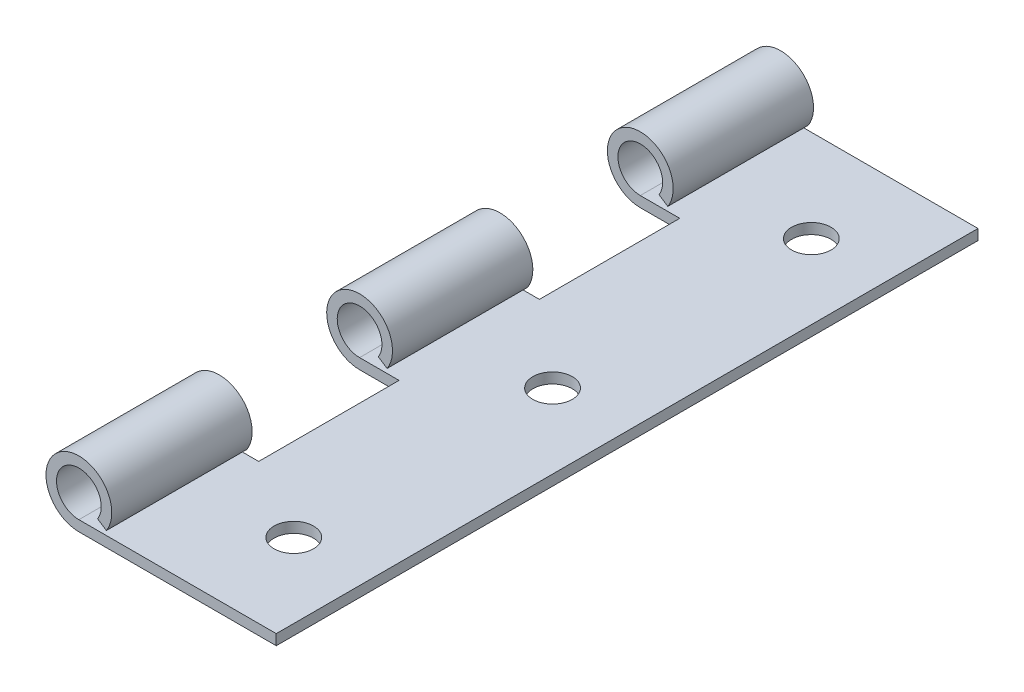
from build123d import *

# Parameters (mm, degrees)
BOSS_EXTRU_1_DEPTH      = 40
ESQUISSE2_R             = 2.25
ENL_V_MAT_EXTRU_1_DEPTH = 47.324291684
ESQUISSE3_W             = 8.25
ESQUISSE3_H             = 16
ENL_V_MAT_EXTRU_2_DEPTH = 47.502688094


with BuildPart() as part:
    # Esquisse1 → Boss.-Extru.1 (new, symmetric)
    with BuildSketch(Plane.XY):
        with BuildLine():
            Line((0, -3.75), (22.5, -3.75))
            Line((22.5, -3.75), (22.5, -2.55))
            Line((22.5, -2.55), (0, -2.55))
            ThreePointArc((0, -2.55), (-1.214042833, 2.242454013), (2.135243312, -1.394))
            Line((2.135243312, -1.394), (3.140063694, -2.05))
            ThreePointArc((3.140063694, -2.05), (-1.785357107, 3.29772649), (0, -3.75))
        make_face()
    extrude(amount=BOSS_EXTRU_1_DEPTH, both=True)

    # Esquisse2 → Enl_v. mat.-Extru.1 (cut, through all)
    with BuildSketch(Plane(origin=(0, -2.55, 0), x_dir=(1, 0, 0), z_dir=(0, 1, 0))):
        with Locations(Location((14, 0, 0), (0, 0, 180))):
            Circle(ESQUISSE2_R)
        with Locations(Location((14, 29.5, 0), (0, 0, 180))):
            Circle(ESQUISSE2_R)
        with Locations(Location((14, -29.5, 0), (0, 0, 180))):
            Circle(ESQUISSE2_R)
    extrude(amount=-ENL_V_MAT_EXTRU_1_DEPTH, mode=Mode.SUBTRACT)

    # Esquisse3 → Enl_v. mat.-Extru.2 (cut, through all)
    with BuildSketch(Plane.XZ.offset(3.75)):
        with Locations((0.375, 16)):
            Rectangle(ESQUISSE3_W, ESQUISSE3_H)
        with Locations((0.375, -16)):
            Rectangle(ESQUISSE3_W, ESQUISSE3_H)
    extrude(amount=-ENL_V_MAT_EXTRU_2_DEPTH, mode=Mode.SUBTRACT)


solid = part.part
